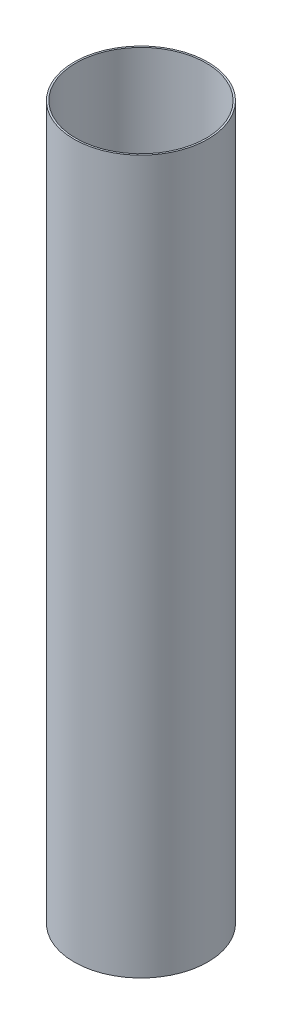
ISO-10303-21;
HEADER;
FILE_DESCRIPTION(('STEP AP214'),'2;1');
FILE_NAME('part.step','',(''),(''),'','','');
FILE_SCHEMA(('AUTOMOTIVE_DESIGN { 1 0 10303 214 1 1 1 1 }'));
ENDSEC;
DATA;
#1=APPLICATION_CONTEXT('core data for automotive mechanical design processes');
#2=APPLICATION_PROTOCOL_DEFINITION('international standard','automotive_design',2000,#1);
#3=PRODUCT_CONTEXT('',#1,'mechanical');
#4=PRODUCT('Part','Part','',(#3));
#5=PRODUCT_RELATED_PRODUCT_CATEGORY('part','',(#4));
#6=PRODUCT_DEFINITION_FORMATION('','',#4);
#7=PRODUCT_DEFINITION_CONTEXT('part definition',#1,'design');
#8=PRODUCT_DEFINITION('design','',#6,#7);
#9=PRODUCT_DEFINITION_SHAPE('','',#8);
#10=(LENGTH_UNIT() NAMED_UNIT(*) SI_UNIT(.MILLI.,.METRE.));
#11=(NAMED_UNIT(*) PLANE_ANGLE_UNIT() SI_UNIT($,.RADIAN.));
#12=(NAMED_UNIT(*) SI_UNIT($,.STERADIAN.) SOLID_ANGLE_UNIT());
#13=UNCERTAINTY_MEASURE_WITH_UNIT(LENGTH_MEASURE(1.E-05),#10,'distance_accuracy_value','');
#14=(GEOMETRIC_REPRESENTATION_CONTEXT(3) GLOBAL_UNCERTAINTY_ASSIGNED_CONTEXT((#13)) GLOBAL_UNIT_ASSIGNED_CONTEXT((#10,
#11,#12)) REPRESENTATION_CONTEXT('',''));
#15=CARTESIAN_POINT('',(0.,0.,0.));
#16=DIRECTION('',(0.,0.,1.));
#17=DIRECTION('',(1.,0.,0.));
#18=AXIS2_PLACEMENT_3D('',#15,#16,#17);
#19=CARTESIAN_POINT('',(0.,744.22,0.));
#20=DIRECTION('',(0.,1.,0.));
#21=DIRECTION('',(0.,0.,1.));
#22=AXIS2_PLACEMENT_3D('',#19,#20,#21);
#23=PLANE('',#22);
#24=CARTESIAN_POINT('',(0.,744.22,0.));
#25=DIRECTION('',(0.,1.,0.));
#26=DIRECTION('',(0.,0.,1.));
#27=AXIS2_PLACEMENT_3D('',#24,#25,#26);
#28=CIRCLE('',#27,69.85);
#29=CARTESIAN_POINT('',(0.,744.22,69.85));
#30=VERTEX_POINT('',#29);
#31=EDGE_CURVE('E10',#30,#30,#28,.T.);
#32=ORIENTED_EDGE('',*,*,#31,.T.);
#33=EDGE_LOOP('',(#32));
#34=FACE_BOUND('',#33,.T.);
#35=CARTESIAN_POINT('',(0.,744.22,0.));
#36=DIRECTION('',(0.,1.,0.));
#37=DIRECTION('',(0.,0.,1.));
#38=AXIS2_PLACEMENT_3D('',#35,#36,#37);
#39=CIRCLE('',#38,68.072);
#40=CARTESIAN_POINT('',(0.,744.22,68.072));
#41=VERTEX_POINT('',#40);
#42=EDGE_CURVE('E48',#41,#41,#39,.T.);
#43=ORIENTED_EDGE('',*,*,#42,.F.);
#44=EDGE_LOOP('',(#43));
#45=FACE_BOUND('',#44,.T.);
#46=ADVANCED_FACE('F37',(#34,#45),#23,.T.);
#47=CARTESIAN_POINT('',(0.,0.,0.));
#48=DIRECTION('',(0.,1.,0.));
#49=DIRECTION('',(0.,0.,1.));
#50=AXIS2_PLACEMENT_3D('',#47,#48,#49);
#51=PLANE('',#50);
#52=CARTESIAN_POINT('',(0.,0.,0.));
#53=DIRECTION('',(0.,1.,0.));
#54=DIRECTION('',(0.,0.,1.));
#55=AXIS2_PLACEMENT_3D('',#52,#53,#54);
#56=CIRCLE('',#55,69.85);
#57=CARTESIAN_POINT('',(0.,0.,69.85));
#58=VERTEX_POINT('',#57);
#59=EDGE_CURVE('E41',#58,#58,#56,.T.);
#60=ORIENTED_EDGE('',*,*,#59,.F.);
#61=EDGE_LOOP('',(#60));
#62=FACE_BOUND('',#61,.T.);
#63=CARTESIAN_POINT('',(0.,0.,0.));
#64=DIRECTION('',(0.,1.,0.));
#65=DIRECTION('',(0.,0.,1.));
#66=AXIS2_PLACEMENT_3D('',#63,#64,#65);
#67=CIRCLE('',#66,68.072);
#68=CARTESIAN_POINT('',(0.,0.,68.072));
#69=VERTEX_POINT('',#68);
#70=EDGE_CURVE('E50',#69,#69,#67,.T.);
#71=ORIENTED_EDGE('',*,*,#70,.T.);
#72=EDGE_LOOP('',(#71));
#73=FACE_BOUND('',#72,.T.);
#74=ADVANCED_FACE('F60',(#62,#73),#51,.F.);
#75=CARTESIAN_POINT('',(0.,744.22,0.));
#76=DIRECTION('',(0.,-1.,0.));
#77=DIRECTION('',(0.,0.,-1.));
#78=AXIS2_PLACEMENT_3D('',#75,#76,#77);
#79=CYLINDRICAL_SURFACE('',#78,69.85);
#80=ORIENTED_EDGE('',*,*,#31,.F.);
#81=EDGE_LOOP('',(#80));
#82=FACE_BOUND('',#81,.T.);
#83=ORIENTED_EDGE('',*,*,#59,.T.);
#84=EDGE_LOOP('',(#83));
#85=FACE_BOUND('',#84,.T.);
#86=ADVANCED_FACE('F39',(#82,#85),#79,.T.);
#87=CARTESIAN_POINT('',(0.,744.22,0.));
#88=DIRECTION('',(0.,-1.,0.));
#89=DIRECTION('',(0.,0.,-1.));
#90=AXIS2_PLACEMENT_3D('',#87,#88,#89);
#91=CYLINDRICAL_SURFACE('',#90,68.072);
#92=ORIENTED_EDGE('',*,*,#42,.T.);
#93=EDGE_LOOP('',(#92));
#94=FACE_BOUND('',#93,.T.);
#95=ORIENTED_EDGE('',*,*,#70,.F.);
#96=EDGE_LOOP('',(#95));
#97=FACE_BOUND('',#96,.T.);
#98=ADVANCED_FACE('F56',(#94,#97),#91,.F.);
#99=CLOSED_SHELL('',(#46,#74,#86,#98));
#100=MANIFOLD_SOLID_BREP('B2',#99);
#101=ADVANCED_BREP_SHAPE_REPRESENTATION('',(#18,#100),#14);
#102=SHAPE_DEFINITION_REPRESENTATION(#9,#101);
ENDSEC;
END-ISO-10303-21;
